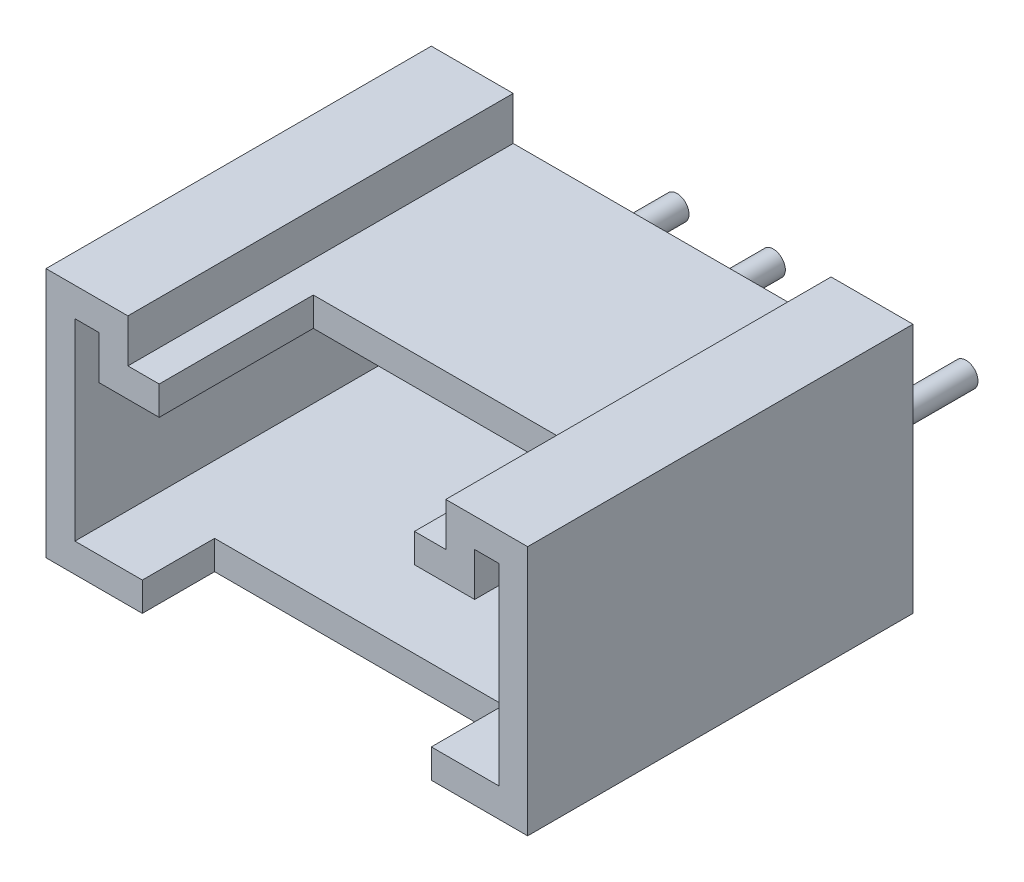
from build123d import *

# Parameters (mm, degrees)
BOSS_EXTRU_1_DEPTH      = 8
COQUE1_T                = -0.6
ESQUISSE2_R             = 0.25
BOSS_EXTRU_2_DEPTH      = 3.1
ESQUISSE3_W             = 6
ESQUISSE3_H             = 1.5
ENL_V_MAT_EXTRU_1_DEPTH = 0.6
ESQUISSE4_W             = 5.3
ESQUISSE4_H             = 3.2
ENL_V_MAT_EXTRU_2_DEPTH = 0.6


with BuildPart() as part:
    # Esquisse1 → Boss.-Extru.1 (new body)
    with BuildSketch(Plane.XY):
        Polygon((3.3, 4.3), (3.3, 5.2), (5, 5.2), (5, 0), (-5, 0), (-5, 5.2), (-3.3, 5.2), (-3.3, 4.3), align=None)
    extrude(amount=BOSS_EXTRU_1_DEPTH)

    # Coque1
    coque1_openings = [part.faces().sort_by_distance(p)[0] for p in [
        (0, 2.32273122, 8),
    ]]
    offset(amount=COQUE1_T, openings=coque1_openings, kind=Kind.INTERSECTION)

    # Esquisse2 → Boss.-Extru.2 (add)
    with BuildSketch(Plane(origin=(0, 0, 0), x_dir=(-1, 0, 0), z_dir=(0, 0, -1))):
        with Locations(Location((-1, 1.752205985, 0), (0, 0, 180))):
            Circle(ESQUISSE2_R)
        with Locations(Location((1, 1.752205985, 0), (0, 0, 180))):
            Circle(ESQUISSE2_R)
        with Locations(Location((3, 1.752205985, 0), (0, 0, 180))):
            Circle(ESQUISSE2_R)
        with Locations(Location((-3, 1.752205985, 0), (0, 0, 180))):
            Circle(ESQUISSE2_R)
    extrude(amount=BOSS_EXTRU_2_DEPTH)

    # Esquisse3 → Enl_v. mat.-Extru.1 (cut)
    with BuildSketch(Plane.XZ):
        with Locations((0, 7.25)):
            Rectangle(ESQUISSE3_W, ESQUISSE3_H)
    extrude(amount=-ENL_V_MAT_EXTRU_1_DEPTH, mode=Mode.SUBTRACT)

    # Esquisse4 → Enl_v. mat.-Extru.2 (cut)
    with BuildSketch(Plane(origin=(0, 4.3, 0), x_dir=(1, 0, 0), z_dir=(0, 1, 0))):
        with Locations((0, -6.4)):
            Rectangle(ESQUISSE4_W, ESQUISSE4_H)
    extrude(amount=-ENL_V_MAT_EXTRU_2_DEPTH, mode=Mode.SUBTRACT)


solid = part.part
